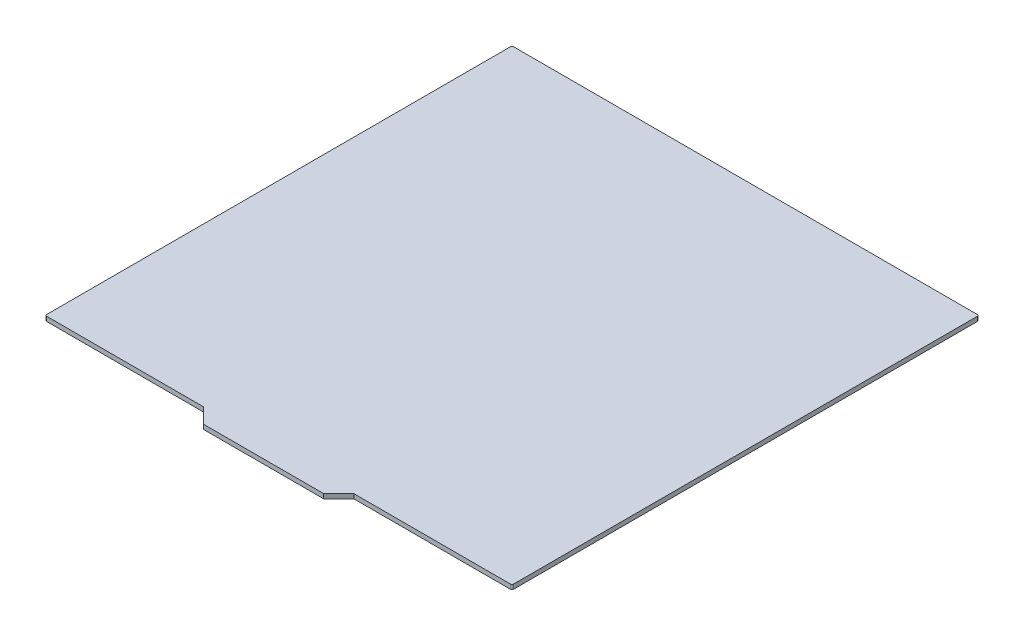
ISO-10303-21;
HEADER;
FILE_DESCRIPTION(('STEP AP214'),'2;1');
FILE_NAME('part.step','',(''),(''),'','','');
FILE_SCHEMA(('AUTOMOTIVE_DESIGN { 1 0 10303 214 1 1 1 1 }'));
ENDSEC;
DATA;
#1=APPLICATION_CONTEXT('core data for automotive mechanical design processes');
#2=APPLICATION_PROTOCOL_DEFINITION('international standard','automotive_design',2000,#1);
#3=PRODUCT_CONTEXT('',#1,'mechanical');
#4=PRODUCT('Part','Part','',(#3));
#5=PRODUCT_RELATED_PRODUCT_CATEGORY('part','',(#4));
#6=PRODUCT_DEFINITION_FORMATION('','',#4);
#7=PRODUCT_DEFINITION_CONTEXT('part definition',#1,'design');
#8=PRODUCT_DEFINITION('design','',#6,#7);
#9=PRODUCT_DEFINITION_SHAPE('','',#8);
#10=(LENGTH_UNIT() NAMED_UNIT(*) SI_UNIT(.MILLI.,.METRE.));
#11=(NAMED_UNIT(*) PLANE_ANGLE_UNIT() SI_UNIT($,.RADIAN.));
#12=(NAMED_UNIT(*) SI_UNIT($,.STERADIAN.) SOLID_ANGLE_UNIT());
#13=UNCERTAINTY_MEASURE_WITH_UNIT(LENGTH_MEASURE(1.E-05),#10,'distance_accuracy_value','');
#14=(GEOMETRIC_REPRESENTATION_CONTEXT(3) GLOBAL_UNCERTAINTY_ASSIGNED_CONTEXT((#13)) GLOBAL_UNIT_ASSIGNED_CONTEXT((#10,
#11,#12)) REPRESENTATION_CONTEXT('',''));
#15=CARTESIAN_POINT('',(0.,0.,0.));
#16=DIRECTION('',(0.,0.,1.));
#17=DIRECTION('',(1.,0.,0.));
#18=AXIS2_PLACEMENT_3D('',#15,#16,#17);
#19=CARTESIAN_POINT('',(155.,3.,155.));
#20=DIRECTION('',(-1.,0.,0.));
#21=DIRECTION('',(0.,0.,1.));
#22=AXIS2_PLACEMENT_3D('',#19,#20,#21);
#23=PLANE('',#22);
#24=DIRECTION('',(0.,0.,-1.));
#25=VECTOR('',#24,1.);
#26=CARTESIAN_POINT('',(155.,0.,155.));
#27=LINE('',#26,#25);
#28=CARTESIAN_POINT('',(155.,0.,154.));
#29=VERTEX_POINT('',#28);
#30=CARTESIAN_POINT('',(155.,0.,-154.));
#31=VERTEX_POINT('',#30);
#32=EDGE_CURVE('E164',#29,#31,#27,.T.);
#33=ORIENTED_EDGE('',*,*,#32,.T.);
#34=DIRECTION('',(0.,-1.,0.));
#35=VECTOR('',#34,1.);
#36=CARTESIAN_POINT('',(155.,3.,-154.));
#37=LINE('',#36,#35);
#38=CARTESIAN_POINT('',(155.,3.,-154.));
#39=VERTEX_POINT('',#38);
#40=EDGE_CURVE('E45',#31,#39,#37,.F.);
#41=ORIENTED_EDGE('',*,*,#40,.T.);
#42=DIRECTION('',(0.,0.,-1.));
#43=VECTOR('',#42,1.);
#44=CARTESIAN_POINT('',(155.,3.,155.));
#45=LINE('',#44,#43);
#46=CARTESIAN_POINT('',(155.,3.,154.));
#47=VERTEX_POINT('',#46);
#48=EDGE_CURVE('E181',#47,#39,#45,.T.);
#49=ORIENTED_EDGE('',*,*,#48,.F.);
#50=DIRECTION('',(0.,-1.,0.));
#51=VECTOR('',#50,1.);
#52=CARTESIAN_POINT('',(155.,3.,154.));
#53=LINE('',#52,#51);
#54=EDGE_CURVE('E213',#47,#29,#53,.T.);
#55=ORIENTED_EDGE('',*,*,#54,.T.);
#56=EDGE_LOOP('',(#33,#41,#49,#55));
#57=FACE_BOUND('',#56,.T.);
#58=ADVANCED_FACE('F37',(#57),#23,.F.);
#59=CARTESIAN_POINT('',(-155.,3.,-155.));
#60=DIRECTION('',(0.,0.,1.));
#61=DIRECTION('',(1.,0.,0.));
#62=AXIS2_PLACEMENT_3D('',#59,#60,#61);
#63=PLANE('',#62);
#64=DIRECTION('',(-1.,0.,0.));
#65=VECTOR('',#64,1.);
#66=CARTESIAN_POINT('',(-155.,0.,-155.));
#67=LINE('',#66,#65);
#68=CARTESIAN_POINT('',(154.,0.,-155.));
#69=VERTEX_POINT('',#68);
#70=CARTESIAN_POINT('',(-154.,0.,-155.));
#71=VERTEX_POINT('',#70);
#72=EDGE_CURVE('E167',#69,#71,#67,.T.);
#73=ORIENTED_EDGE('',*,*,#72,.T.);
#74=DIRECTION('',(0.,-1.,0.));
#75=VECTOR('',#74,1.);
#76=CARTESIAN_POINT('',(-154.,3.,-155.));
#77=LINE('',#76,#75);
#78=CARTESIAN_POINT('',(-154.,3.,-155.));
#79=VERTEX_POINT('',#78);
#80=EDGE_CURVE('E58',#71,#79,#77,.F.);
#81=ORIENTED_EDGE('',*,*,#80,.T.);
#82=DIRECTION('',(-1.,0.,0.));
#83=VECTOR('',#82,1.);
#84=CARTESIAN_POINT('',(-155.,3.,-155.));
#85=LINE('',#84,#83);
#86=CARTESIAN_POINT('',(154.,3.,-155.));
#87=VERTEX_POINT('',#86);
#88=EDGE_CURVE('E224',#87,#79,#85,.T.);
#89=ORIENTED_EDGE('',*,*,#88,.F.);
#90=DIRECTION('',(0.,-1.,0.));
#91=VECTOR('',#90,1.);
#92=CARTESIAN_POINT('',(154.,3.,-155.));
#93=LINE('',#92,#91);
#94=EDGE_CURVE('E209',#87,#69,#93,.T.);
#95=ORIENTED_EDGE('',*,*,#94,.T.);
#96=EDGE_LOOP('',(#73,#81,#89,#95));
#97=FACE_BOUND('',#96,.T.);
#98=ADVANCED_FACE('F229',(#97),#63,.F.);
#99=CARTESIAN_POINT('',(-155.,3.,155.));
#100=DIRECTION('',(1.,0.,0.));
#101=DIRECTION('',(0.,0.,-1.));
#102=AXIS2_PLACEMENT_3D('',#99,#100,#101);
#103=PLANE('',#102);
#104=DIRECTION('',(0.,0.,1.));
#105=VECTOR('',#104,1.);
#106=CARTESIAN_POINT('',(-155.,0.,155.));
#107=LINE('',#106,#105);
#108=CARTESIAN_POINT('',(-155.,0.,-154.));
#109=VERTEX_POINT('',#108);
#110=CARTESIAN_POINT('',(-155.,0.,154.));
#111=VERTEX_POINT('',#110);
#112=EDGE_CURVE('E169',#109,#111,#107,.T.);
#113=ORIENTED_EDGE('',*,*,#112,.T.);
#114=DIRECTION('',(0.,-1.,0.));
#115=VECTOR('',#114,1.);
#116=CARTESIAN_POINT('',(-155.,3.,154.));
#117=LINE('',#116,#115);
#118=CARTESIAN_POINT('',(-155.,3.,154.));
#119=VERTEX_POINT('',#118);
#120=EDGE_CURVE('E200',#111,#119,#117,.F.);
#121=ORIENTED_EDGE('',*,*,#120,.T.);
#122=DIRECTION('',(0.,0.,1.));
#123=VECTOR('',#122,1.);
#124=CARTESIAN_POINT('',(-155.,3.,155.));
#125=LINE('',#124,#123);
#126=CARTESIAN_POINT('',(-155.,3.,-154.));
#127=VERTEX_POINT('',#126);
#128=EDGE_CURVE('E139',#127,#119,#125,.T.);
#129=ORIENTED_EDGE('',*,*,#128,.F.);
#130=DIRECTION('',(0.,-1.,0.));
#131=VECTOR('',#130,1.);
#132=CARTESIAN_POINT('',(-155.,3.,-154.));
#133=LINE('',#132,#131);
#134=EDGE_CURVE('E197',#127,#109,#133,.T.);
#135=ORIENTED_EDGE('',*,*,#134,.T.);
#136=EDGE_LOOP('',(#113,#121,#129,#135));
#137=FACE_BOUND('',#136,.T.);
#138=ADVANCED_FACE('F239',(#137),#103,.F.);
#139=CARTESIAN_POINT('',(-155.,3.,155.));
#140=DIRECTION('',(0.,0.,-1.));
#141=DIRECTION('',(-1.,0.,0.));
#142=AXIS2_PLACEMENT_3D('',#139,#140,#141);
#143=PLANE('',#142);
#144=DIRECTION('',(1.,0.,0.));
#145=VECTOR('',#144,1.);
#146=CARTESIAN_POINT('',(-155.,3.,155.));
#147=LINE('',#146,#145);
#148=CARTESIAN_POINT('',(-154.,3.,155.));
#149=VERTEX_POINT('',#148);
#150=CARTESIAN_POINT('',(-50.,3.,155.));
#151=VERTEX_POINT('',#150);
#152=EDGE_CURVE('E127',#149,#151,#147,.T.);
#153=ORIENTED_EDGE('',*,*,#152,.F.);
#154=DIRECTION('',(0.,-1.,0.));
#155=VECTOR('',#154,1.);
#156=CARTESIAN_POINT('',(-154.,3.,155.));
#157=LINE('',#156,#155);
#158=CARTESIAN_POINT('',(-154.,0.,155.));
#159=VERTEX_POINT('',#158);
#160=EDGE_CURVE('E148',#149,#159,#157,.T.);
#161=ORIENTED_EDGE('',*,*,#160,.T.);
#162=DIRECTION('',(1.,0.,0.));
#163=VECTOR('',#162,1.);
#164=CARTESIAN_POINT('',(-155.,0.,155.));
#165=LINE('',#164,#163);
#166=CARTESIAN_POINT('',(-50.,0.,155.));
#167=VERTEX_POINT('',#166);
#168=EDGE_CURVE('E145',#159,#167,#165,.T.);
#169=ORIENTED_EDGE('',*,*,#168,.T.);
#170=DIRECTION('',(0.,-1.,0.));
#171=VECTOR('',#170,1.);
#172=CARTESIAN_POINT('',(-50.,3.,155.));
#173=LINE('',#172,#171);
#174=EDGE_CURVE('E142',#151,#167,#173,.T.);
#175=ORIENTED_EDGE('',*,*,#174,.F.);
#176=EDGE_LOOP('',(#153,#161,#169,#175));
#177=FACE_BOUND('',#176,.T.);
#178=ADVANCED_FACE('F143',(#177),#143,.F.);
#179=CARTESIAN_POINT('',(-50.,3.,155.));
#180=DIRECTION('',(0.707106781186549,0.,-0.707106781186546));
#181=DIRECTION('',(-0.707106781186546,0.,-0.707106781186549));
#182=AXIS2_PLACEMENT_3D('',#179,#180,#181);
#183=PLANE('',#182);
#184=DIRECTION('',(0.707106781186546,0.,0.707106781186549));
#185=VECTOR('',#184,1.);
#186=CARTESIAN_POINT('',(-50.,0.,155.));
#187=LINE('',#186,#185);
#188=CARTESIAN_POINT('',(-40.,0.,165.));
#189=VERTEX_POINT('',#188);
#190=EDGE_CURVE('E173',#167,#189,#187,.T.);
#191=ORIENTED_EDGE('',*,*,#190,.T.);
#192=DIRECTION('',(0.,-1.,0.));
#193=VECTOR('',#192,1.);
#194=CARTESIAN_POINT('',(-40.,3.,165.));
#195=LINE('',#194,#193);
#196=CARTESIAN_POINT('',(-40.,3.,165.));
#197=VERTEX_POINT('',#196);
#198=EDGE_CURVE('E149',#197,#189,#195,.T.);
#199=ORIENTED_EDGE('',*,*,#198,.F.);
#200=DIRECTION('',(0.707106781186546,0.,0.707106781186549));
#201=VECTOR('',#200,1.);
#202=CARTESIAN_POINT('',(-50.,3.,155.));
#203=LINE('',#202,#201);
#204=EDGE_CURVE('E132',#151,#197,#203,.T.);
#205=ORIENTED_EDGE('',*,*,#204,.F.);
#206=ORIENTED_EDGE('',*,*,#174,.T.);
#207=EDGE_LOOP('',(#191,#199,#205,#206));
#208=FACE_BOUND('',#207,.T.);
#209=ADVANCED_FACE('F151',(#208),#183,.F.);
#210=CARTESIAN_POINT('',(-40.,3.,165.));
#211=DIRECTION('',(0.,0.,-1.));
#212=DIRECTION('',(-1.,0.,0.));
#213=AXIS2_PLACEMENT_3D('',#210,#211,#212);
#214=PLANE('',#213);
#215=DIRECTION('',(1.,0.,0.));
#216=VECTOR('',#215,1.);
#217=CARTESIAN_POINT('',(-40.,0.,165.));
#218=LINE('',#217,#216);
#219=CARTESIAN_POINT('',(40.,0.,165.));
#220=VERTEX_POINT('',#219);
#221=EDGE_CURVE('E175',#189,#220,#218,.T.);
#222=ORIENTED_EDGE('',*,*,#221,.T.);
#223=DIRECTION('',(0.,-1.,0.));
#224=VECTOR('',#223,1.);
#225=CARTESIAN_POINT('',(40.,3.,165.));
#226=LINE('',#225,#224);
#227=CARTESIAN_POINT('',(40.,3.,165.));
#228=VERTEX_POINT('',#227);
#229=EDGE_CURVE('E184',#228,#220,#226,.T.);
#230=ORIENTED_EDGE('',*,*,#229,.F.);
#231=DIRECTION('',(1.,0.,0.));
#232=VECTOR('',#231,1.);
#233=CARTESIAN_POINT('',(-40.,3.,165.));
#234=LINE('',#233,#232);
#235=EDGE_CURVE('E154',#197,#228,#234,.T.);
#236=ORIENTED_EDGE('',*,*,#235,.F.);
#237=ORIENTED_EDGE('',*,*,#198,.T.);
#238=EDGE_LOOP('',(#222,#230,#236,#237));
#239=FACE_BOUND('',#238,.T.);
#240=ADVANCED_FACE('F247',(#239),#214,.F.);
#241=CARTESIAN_POINT('',(40.,3.,165.));
#242=DIRECTION('',(-0.707106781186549,0.,-0.707106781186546));
#243=DIRECTION('',(-0.707106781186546,0.,0.707106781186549));
#244=AXIS2_PLACEMENT_3D('',#241,#242,#243);
#245=PLANE('',#244);
#246=DIRECTION('',(0.707106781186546,0.,-0.707106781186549));
#247=VECTOR('',#246,1.);
#248=CARTESIAN_POINT('',(40.,0.,165.));
#249=LINE('',#248,#247);
#250=CARTESIAN_POINT('',(50.,0.,155.));
#251=VERTEX_POINT('',#250);
#252=EDGE_CURVE('E177',#220,#251,#249,.T.);
#253=ORIENTED_EDGE('',*,*,#252,.T.);
#254=DIRECTION('',(0.,-1.,0.));
#255=VECTOR('',#254,1.);
#256=CARTESIAN_POINT('',(50.,3.,155.));
#257=LINE('',#256,#255);
#258=CARTESIAN_POINT('',(50.,3.,155.));
#259=VERTEX_POINT('',#258);
#260=EDGE_CURVE('E163',#259,#251,#257,.T.);
#261=ORIENTED_EDGE('',*,*,#260,.F.);
#262=DIRECTION('',(0.707106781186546,0.,-0.707106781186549));
#263=VECTOR('',#262,1.);
#264=CARTESIAN_POINT('',(40.,3.,165.));
#265=LINE('',#264,#263);
#266=EDGE_CURVE('E156',#228,#259,#265,.T.);
#267=ORIENTED_EDGE('',*,*,#266,.F.);
#268=ORIENTED_EDGE('',*,*,#229,.T.);
#269=EDGE_LOOP('',(#253,#261,#267,#268));
#270=FACE_BOUND('',#269,.T.);
#271=ADVANCED_FACE('F252',(#270),#245,.F.);
#272=CARTESIAN_POINT('',(50.,3.,155.));
#273=DIRECTION('',(0.,0.,-1.));
#274=DIRECTION('',(-1.,0.,0.));
#275=AXIS2_PLACEMENT_3D('',#272,#273,#274);
#276=PLANE('',#275);
#277=DIRECTION('',(1.,0.,0.));
#278=VECTOR('',#277,1.);
#279=CARTESIAN_POINT('',(50.,0.,155.));
#280=LINE('',#279,#278);
#281=CARTESIAN_POINT('',(154.,0.,155.));
#282=VERTEX_POINT('',#281);
#283=EDGE_CURVE('E179',#251,#282,#280,.T.);
#284=ORIENTED_EDGE('',*,*,#283,.T.);
#285=DIRECTION('',(0.,-1.,0.));
#286=VECTOR('',#285,1.);
#287=CARTESIAN_POINT('',(154.,3.,155.));
#288=LINE('',#287,#286);
#289=CARTESIAN_POINT('',(154.,3.,155.));
#290=VERTEX_POINT('',#289);
#291=EDGE_CURVE('E11',#282,#290,#288,.F.);
#292=ORIENTED_EDGE('',*,*,#291,.T.);
#293=DIRECTION('',(1.,0.,0.));
#294=VECTOR('',#293,1.);
#295=CARTESIAN_POINT('',(50.,3.,155.));
#296=LINE('',#295,#294);
#297=EDGE_CURVE('E161',#259,#290,#296,.T.);
#298=ORIENTED_EDGE('',*,*,#297,.F.);
#299=ORIENTED_EDGE('',*,*,#260,.T.);
#300=EDGE_LOOP('',(#284,#292,#298,#299));
#301=FACE_BOUND('',#300,.T.);
#302=ADVANCED_FACE('F254',(#301),#276,.F.);
#303=CARTESIAN_POINT('',(0.,3.,0.));
#304=DIRECTION('',(0.,-1.,0.));
#305=DIRECTION('',(0.,0.,-1.));
#306=AXIS2_PLACEMENT_3D('',#303,#304,#305);
#307=PLANE('',#306);
#308=ORIENTED_EDGE('',*,*,#128,.T.);
#309=CARTESIAN_POINT('',(-154.,3.,154.));
#310=DIRECTION('',(0.,-1.,0.));
#311=DIRECTION('',(0.,0.,-1.));
#312=AXIS2_PLACEMENT_3D('',#309,#310,#311);
#313=CIRCLE('',#312,1.);
#314=EDGE_CURVE('E135',#119,#149,#313,.F.);
#315=ORIENTED_EDGE('',*,*,#314,.T.);
#316=ORIENTED_EDGE('',*,*,#152,.T.);
#317=ORIENTED_EDGE('',*,*,#204,.T.);
#318=ORIENTED_EDGE('',*,*,#235,.T.);
#319=ORIENTED_EDGE('',*,*,#266,.T.);
#320=ORIENTED_EDGE('',*,*,#297,.T.);
#321=CARTESIAN_POINT('',(154.,3.,154.));
#322=DIRECTION('',(0.,-1.,0.));
#323=DIRECTION('',(0.,0.,-1.));
#324=AXIS2_PLACEMENT_3D('',#321,#322,#323);
#325=CIRCLE('',#324,1.);
#326=EDGE_CURVE('E202',#290,#47,#325,.F.);
#327=ORIENTED_EDGE('',*,*,#326,.T.);
#328=ORIENTED_EDGE('',*,*,#48,.T.);
#329=CARTESIAN_POINT('',(154.,3.,-154.));
#330=DIRECTION('',(0.,-1.,0.));
#331=DIRECTION('',(0.,0.,-1.));
#332=AXIS2_PLACEMENT_3D('',#329,#330,#331);
#333=CIRCLE('',#332,1.);
#334=EDGE_CURVE('E204',#39,#87,#333,.F.);
#335=ORIENTED_EDGE('',*,*,#334,.T.);
#336=ORIENTED_EDGE('',*,*,#88,.T.);
#337=CARTESIAN_POINT('',(-154.,3.,-154.));
#338=DIRECTION('',(0.,-1.,0.));
#339=DIRECTION('',(0.,0.,-1.));
#340=AXIS2_PLACEMENT_3D('',#337,#338,#339);
#341=CIRCLE('',#340,1.);
#342=EDGE_CURVE('E206',#79,#127,#341,.F.);
#343=ORIENTED_EDGE('',*,*,#342,.T.);
#344=EDGE_LOOP('',(#308,#315,#316,#317,#318,#319,#320,#327,#328,#335,#336,#343));
#345=FACE_BOUND('',#344,.T.);
#346=ADVANCED_FACE('F130',(#345),#307,.F.);
#347=CARTESIAN_POINT('',(0.,0.,0.));
#348=DIRECTION('',(0.,-1.,0.));
#349=DIRECTION('',(0.,0.,-1.));
#350=AXIS2_PLACEMENT_3D('',#347,#348,#349);
#351=PLANE('',#350);
#352=ORIENTED_EDGE('',*,*,#168,.F.);
#353=CARTESIAN_POINT('',(-154.,0.,154.));
#354=DIRECTION('',(0.,-1.,0.));
#355=DIRECTION('',(0.,0.,-1.));
#356=AXIS2_PLACEMENT_3D('',#353,#354,#355);
#357=CIRCLE('',#356,1.);
#358=EDGE_CURVE('E195',#159,#111,#357,.T.);
#359=ORIENTED_EDGE('',*,*,#358,.T.);
#360=ORIENTED_EDGE('',*,*,#112,.F.);
#361=CARTESIAN_POINT('',(-154.,0.,-154.));
#362=DIRECTION('',(0.,-1.,0.));
#363=DIRECTION('',(0.,0.,-1.));
#364=AXIS2_PLACEMENT_3D('',#361,#362,#363);
#365=CIRCLE('',#364,1.);
#366=EDGE_CURVE('E193',#109,#71,#365,.T.);
#367=ORIENTED_EDGE('',*,*,#366,.T.);
#368=ORIENTED_EDGE('',*,*,#72,.F.);
#369=CARTESIAN_POINT('',(154.,0.,-154.));
#370=DIRECTION('',(0.,-1.,0.));
#371=DIRECTION('',(0.,0.,-1.));
#372=AXIS2_PLACEMENT_3D('',#369,#370,#371);
#373=CIRCLE('',#372,1.);
#374=EDGE_CURVE('E191',#69,#31,#373,.T.);
#375=ORIENTED_EDGE('',*,*,#374,.T.);
#376=ORIENTED_EDGE('',*,*,#32,.F.);
#377=CARTESIAN_POINT('',(154.,0.,154.));
#378=DIRECTION('',(0.,-1.,0.));
#379=DIRECTION('',(0.,0.,-1.));
#380=AXIS2_PLACEMENT_3D('',#377,#378,#379);
#381=CIRCLE('',#380,1.);
#382=EDGE_CURVE('E189',#29,#282,#381,.T.);
#383=ORIENTED_EDGE('',*,*,#382,.T.);
#384=ORIENTED_EDGE('',*,*,#283,.F.);
#385=ORIENTED_EDGE('',*,*,#252,.F.);
#386=ORIENTED_EDGE('',*,*,#221,.F.);
#387=ORIENTED_EDGE('',*,*,#190,.F.);
#388=EDGE_LOOP('',(#352,#359,#360,#367,#368,#375,#376,#383,#384,#385,#386,#387));
#389=FACE_BOUND('',#388,.T.);
#390=ADVANCED_FACE('F231',(#389),#351,.T.);
#391=CARTESIAN_POINT('',(-154.,3.,154.));
#392=DIRECTION('',(0.,-1.,0.));
#393=DIRECTION('',(0.,0.,-1.));
#394=AXIS2_PLACEMENT_3D('',#391,#392,#393);
#395=CYLINDRICAL_SURFACE('',#394,1.);
#396=ORIENTED_EDGE('',*,*,#314,.F.);
#397=ORIENTED_EDGE('',*,*,#120,.F.);
#398=ORIENTED_EDGE('',*,*,#358,.F.);
#399=ORIENTED_EDGE('',*,*,#160,.F.);
#400=EDGE_LOOP('',(#396,#397,#398,#399));
#401=FACE_BOUND('',#400,.T.);
#402=ADVANCED_FACE('F243',(#401),#395,.T.);
#403=CARTESIAN_POINT('',(-154.,3.,-154.));
#404=DIRECTION('',(0.,-1.,0.));
#405=DIRECTION('',(0.,0.,-1.));
#406=AXIS2_PLACEMENT_3D('',#403,#404,#405);
#407=CYLINDRICAL_SURFACE('',#406,1.);
#408=ORIENTED_EDGE('',*,*,#342,.F.);
#409=ORIENTED_EDGE('',*,*,#80,.F.);
#410=ORIENTED_EDGE('',*,*,#366,.F.);
#411=ORIENTED_EDGE('',*,*,#134,.F.);
#412=EDGE_LOOP('',(#408,#409,#410,#411));
#413=FACE_BOUND('',#412,.T.);
#414=ADVANCED_FACE('F236',(#413),#407,.T.);
#415=CARTESIAN_POINT('',(154.,3.,-154.));
#416=DIRECTION('',(0.,-1.,0.));
#417=DIRECTION('',(0.,0.,-1.));
#418=AXIS2_PLACEMENT_3D('',#415,#416,#417);
#419=CYLINDRICAL_SURFACE('',#418,1.);
#420=ORIENTED_EDGE('',*,*,#334,.F.);
#421=ORIENTED_EDGE('',*,*,#40,.F.);
#422=ORIENTED_EDGE('',*,*,#374,.F.);
#423=ORIENTED_EDGE('',*,*,#94,.F.);
#424=EDGE_LOOP('',(#420,#421,#422,#423));
#425=FACE_BOUND('',#424,.T.);
#426=ADVANCED_FACE('F227',(#425),#419,.T.);
#427=CARTESIAN_POINT('',(154.,3.,154.));
#428=DIRECTION('',(0.,-1.,0.));
#429=DIRECTION('',(0.,0.,-1.));
#430=AXIS2_PLACEMENT_3D('',#427,#428,#429);
#431=CYLINDRICAL_SURFACE('',#430,1.);
#432=ORIENTED_EDGE('',*,*,#326,.F.);
#433=ORIENTED_EDGE('',*,*,#291,.F.);
#434=ORIENTED_EDGE('',*,*,#382,.F.);
#435=ORIENTED_EDGE('',*,*,#54,.F.);
#436=EDGE_LOOP('',(#432,#433,#434,#435));
#437=FACE_BOUND('',#436,.T.);
#438=ADVANCED_FACE('F39',(#437),#431,.T.);
#439=CLOSED_SHELL('',(#58,#98,#138,#178,#209,#240,#271,#302,#346,#390,#402,#414,#426,#438));
#440=MANIFOLD_SOLID_BREP('B2',#439);
#441=ADVANCED_BREP_SHAPE_REPRESENTATION('',(#18,#440),#14);
#442=SHAPE_DEFINITION_REPRESENTATION(#9,#441);
ENDSEC;
END-ISO-10303-21;
